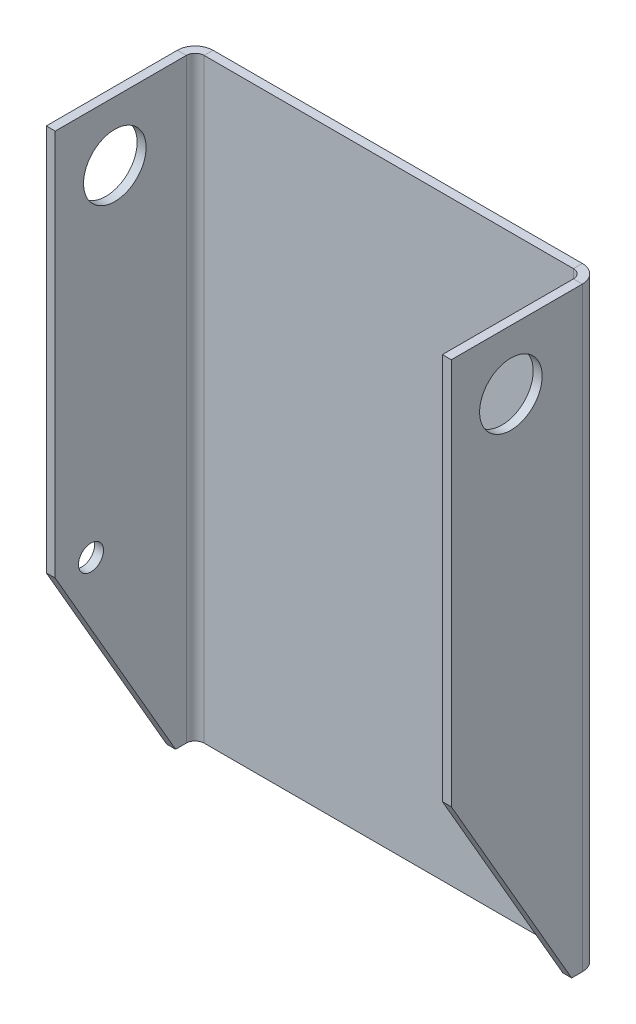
ISO-10303-21;
HEADER;
FILE_DESCRIPTION(('STEP AP214'),'2;1');
FILE_NAME('part.step','',(''),(''),'','','');
FILE_SCHEMA(('AUTOMOTIVE_DESIGN { 1 0 10303 214 1 1 1 1 }'));
ENDSEC;
DATA;
#1=APPLICATION_CONTEXT('core data for automotive mechanical design processes');
#2=APPLICATION_PROTOCOL_DEFINITION('international standard','automotive_design',2000,#1);
#3=PRODUCT_CONTEXT('',#1,'mechanical');
#4=PRODUCT('Part','Part','',(#3));
#5=PRODUCT_RELATED_PRODUCT_CATEGORY('part','',(#4));
#6=PRODUCT_DEFINITION_FORMATION('','',#4);
#7=PRODUCT_DEFINITION_CONTEXT('part definition',#1,'design');
#8=PRODUCT_DEFINITION('design','',#6,#7);
#9=PRODUCT_DEFINITION_SHAPE('','',#8);
#10=(LENGTH_UNIT() NAMED_UNIT(*) SI_UNIT(.MILLI.,.METRE.));
#11=(NAMED_UNIT(*) PLANE_ANGLE_UNIT() SI_UNIT($,.RADIAN.));
#12=(NAMED_UNIT(*) SI_UNIT($,.STERADIAN.) SOLID_ANGLE_UNIT());
#13=UNCERTAINTY_MEASURE_WITH_UNIT(LENGTH_MEASURE(1.E-05),#10,'distance_accuracy_value','');
#14=(GEOMETRIC_REPRESENTATION_CONTEXT(3) GLOBAL_UNCERTAINTY_ASSIGNED_CONTEXT((#13)) GLOBAL_UNIT_ASSIGNED_CONTEXT((#10,
#11,#12)) REPRESENTATION_CONTEXT('',''));
#15=CARTESIAN_POINT('',(0.,0.,0.));
#16=DIRECTION('',(0.,0.,1.));
#17=DIRECTION('',(1.,0.,0.));
#18=AXIS2_PLACEMENT_3D('',#15,#16,#17);
#19=CARTESIAN_POINT('',(-31.,100.,-4.71844785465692E-13));
#20=DIRECTION('',(0.,0.999999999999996,0.));
#21=DIRECTION('',(0.,0.,1.));
#22=AXIS2_PLACEMENT_3D('',#19,#20,#21);
#23=PLANE('',#22);
#24=DIRECTION('',(0.,0.,1.));
#25=VECTOR('',#24,1.);
#26=CARTESIAN_POINT('',(-31.,100.,-4.71844785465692E-13));
#27=LINE('',#26,#25);
#28=CARTESIAN_POINT('',(-31.,100.,-4.71844785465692E-13));
#29=VERTEX_POINT('',#28);
#30=CARTESIAN_POINT('',(-31.,100.,1.49999999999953));
#31=VERTEX_POINT('',#30);
#32=EDGE_CURVE('E311',#29,#31,#27,.T.);
#33=ORIENTED_EDGE('',*,*,#32,.F.);
#34=CARTESIAN_POINT('',(-30.9999999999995,100.,2.99999999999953));
#35=DIRECTION('',(0.,0.999999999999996,0.));
#36=DIRECTION('',(0.,0.,1.));
#37=AXIS2_PLACEMENT_3D('',#34,#35,#36);
#38=CIRCLE('',#37,3.);
#39=CARTESIAN_POINT('',(-33.9999999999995,100.,2.99999999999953));
#40=VERTEX_POINT('',#39);
#41=EDGE_CURVE('E227',#40,#29,#38,.F.);
#42=ORIENTED_EDGE('',*,*,#41,.F.);
#43=DIRECTION('',(-0.999999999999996,0.,0.));
#44=VECTOR('',#43,1.);
#45=CARTESIAN_POINT('',(-32.4999999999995,100.,2.9999999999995));
#46=LINE('',#45,#44);
#47=CARTESIAN_POINT('',(-32.4999999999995,100.,2.9999999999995));
#48=VERTEX_POINT('',#47);
#49=EDGE_CURVE('E308',#48,#40,#46,.T.);
#50=ORIENTED_EDGE('',*,*,#49,.F.);
#51=CARTESIAN_POINT('',(-30.9999999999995,100.,2.99999999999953));
#52=DIRECTION('',(0.,0.999999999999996,0.));
#53=DIRECTION('',(0.999999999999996,0.,0.));
#54=AXIS2_PLACEMENT_3D('',#51,#52,#53);
#55=CIRCLE('',#54,1.5);
#56=EDGE_CURVE('E243',#48,#31,#55,.F.);
#57=ORIENTED_EDGE('',*,*,#56,.T.);
#58=EDGE_LOOP('',(#33,#42,#50,#57));
#59=FACE_BOUND('',#58,.T.);
#60=ADVANCED_FACE('F42',(#59),#23,.T.);
#61=CARTESIAN_POINT('',(-32.4999999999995,100.,2.9999999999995));
#62=DIRECTION('',(0.,0.999999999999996,0.));
#63=DIRECTION('',(0.,0.,1.));
#64=AXIS2_PLACEMENT_3D('',#61,#62,#63);
#65=PLANE('',#64);
#66=DIRECTION('',(0.999999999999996,0.,0.));
#67=VECTOR('',#66,1.);
#68=CARTESIAN_POINT('',(-33.9999999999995,100.,-4.71844785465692E-13));
#69=LINE('',#68,#67);
#70=CARTESIAN_POINT('',(31.,100.,-4.71844785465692E-13));
#71=VERTEX_POINT('',#70);
#72=EDGE_CURVE('E223',#29,#71,#69,.T.);
#73=ORIENTED_EDGE('',*,*,#72,.F.);
#74=ORIENTED_EDGE('',*,*,#32,.T.);
#75=DIRECTION('',(0.999999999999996,0.,0.));
#76=VECTOR('',#75,1.);
#77=CARTESIAN_POINT('',(-34.,100.,1.49999999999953));
#78=LINE('',#77,#76);
#79=CARTESIAN_POINT('',(31.,100.,1.49999999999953));
#80=VERTEX_POINT('',#79);
#81=EDGE_CURVE('E247',#31,#80,#78,.T.);
#82=ORIENTED_EDGE('',*,*,#81,.T.);
#83=DIRECTION('',(0.,0.,-1.));
#84=VECTOR('',#83,1.);
#85=CARTESIAN_POINT('',(31.,100.,1.49999999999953));
#86=LINE('',#85,#84);
#87=EDGE_CURVE('E295',#80,#71,#86,.T.);
#88=ORIENTED_EDGE('',*,*,#87,.T.);
#89=EDGE_LOOP('',(#73,#74,#82,#88));
#90=FACE_BOUND('',#89,.T.);
#91=ADVANCED_FACE('F375',(#90),#65,.T.);
#92=CARTESIAN_POINT('',(-33.9999999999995,0.,2.99999999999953));
#93=DIRECTION('',(0.,-0.999999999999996,0.));
#94=DIRECTION('',(0.,0.,-1.));
#95=AXIS2_PLACEMENT_3D('',#92,#93,#94);
#96=PLANE('',#95);
#97=DIRECTION('',(0.999999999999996,0.,0.));
#98=VECTOR('',#97,1.);
#99=CARTESIAN_POINT('',(-33.9999999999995,0.,2.99999999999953));
#100=LINE('',#99,#98);
#101=CARTESIAN_POINT('',(-33.9999999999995,0.,2.99999999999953));
#102=VERTEX_POINT('',#101);
#103=CARTESIAN_POINT('',(-32.4999999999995,0.,2.99999999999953));
#104=VERTEX_POINT('',#103);
#105=EDGE_CURVE('E304',#102,#104,#100,.T.);
#106=ORIENTED_EDGE('',*,*,#105,.F.);
#107=CARTESIAN_POINT('',(-30.9999999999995,0.,2.99999999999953));
#108=DIRECTION('',(0.,0.999999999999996,0.));
#109=DIRECTION('',(0.,0.,1.));
#110=AXIS2_PLACEMENT_3D('',#107,#108,#109);
#111=CIRCLE('',#110,3.);
#112=CARTESIAN_POINT('',(-31.,0.,-4.71844785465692E-13));
#113=VERTEX_POINT('',#112);
#114=EDGE_CURVE('E188',#102,#113,#111,.F.);
#115=ORIENTED_EDGE('',*,*,#114,.T.);
#116=DIRECTION('',(0.,0.,-1.));
#117=VECTOR('',#116,1.);
#118=CARTESIAN_POINT('',(-31.,0.,1.49999999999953));
#119=LINE('',#118,#117);
#120=CARTESIAN_POINT('',(-31.,0.,1.49999999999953));
#121=VERTEX_POINT('',#120);
#122=EDGE_CURVE('E301',#121,#113,#119,.T.);
#123=ORIENTED_EDGE('',*,*,#122,.F.);
#124=CARTESIAN_POINT('',(-30.9999999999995,0.,2.99999999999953));
#125=DIRECTION('',(0.,0.999999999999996,0.));
#126=DIRECTION('',(0.999999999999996,0.,0.));
#127=AXIS2_PLACEMENT_3D('',#124,#125,#126);
#128=CIRCLE('',#127,1.5);
#129=EDGE_CURVE('E201',#104,#121,#128,.F.);
#130=ORIENTED_EDGE('',*,*,#129,.F.);
#131=EDGE_LOOP('',(#106,#115,#123,#130));
#132=FACE_BOUND('',#131,.T.);
#133=ADVANCED_FACE('F380',(#132),#96,.T.);
#134=CARTESIAN_POINT('',(-31.,0.,1.49999999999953));
#135=DIRECTION('',(0.,-0.999999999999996,0.));
#136=DIRECTION('',(0.,0.,-1.));
#137=AXIS2_PLACEMENT_3D('',#134,#135,#136);
#138=PLANE('',#137);
#139=DIRECTION('',(0.,0.,-1.));
#140=VECTOR('',#139,1.);
#141=CARTESIAN_POINT('',(-32.5,0.,24.9999999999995));
#142=LINE('',#141,#140);
#143=CARTESIAN_POINT('',(-32.4999999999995,0.,4.79274057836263));
#144=VERTEX_POINT('',#143);
#145=EDGE_CURVE('E198',#144,#104,#142,.T.);
#146=ORIENTED_EDGE('',*,*,#145,.F.);
#147=DIRECTION('',(-0.999999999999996,0.,0.));
#148=VECTOR('',#147,1.);
#149=CARTESIAN_POINT('',(-31.,0.,4.79274057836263));
#150=LINE('',#149,#148);
#151=CARTESIAN_POINT('',(-33.9999999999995,0.,4.7927405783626));
#152=VERTEX_POINT('',#151);
#153=EDGE_CURVE('E314',#144,#152,#150,.T.);
#154=ORIENTED_EDGE('',*,*,#153,.T.);
#155=DIRECTION('',(0.,0.,-1.));
#156=VECTOR('',#155,1.);
#157=CARTESIAN_POINT('',(-34.,0.,24.9999999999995));
#158=LINE('',#157,#156);
#159=EDGE_CURVE('E195',#152,#102,#158,.T.);
#160=ORIENTED_EDGE('',*,*,#159,.T.);
#161=ORIENTED_EDGE('',*,*,#105,.T.);
#162=EDGE_LOOP('',(#146,#154,#160,#161));
#163=FACE_BOUND('',#162,.T.);
#164=ADVANCED_FACE('F452',(#163),#138,.T.);
#165=CARTESIAN_POINT('',(33.9999999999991,100.,2.99999999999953));
#166=DIRECTION('',(0.,0.999999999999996,0.));
#167=DIRECTION('',(0.,0.,1.));
#168=AXIS2_PLACEMENT_3D('',#165,#166,#167);
#169=PLANE('',#168);
#170=DIRECTION('',(-0.999999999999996,0.,0.));
#171=VECTOR('',#170,1.);
#172=CARTESIAN_POINT('',(33.9999999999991,100.,2.99999999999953));
#173=LINE('',#172,#171);
#174=CARTESIAN_POINT('',(33.9999999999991,100.,2.99999999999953));
#175=VERTEX_POINT('',#174);
#176=CARTESIAN_POINT('',(32.4999999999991,100.,2.99999999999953));
#177=VERTEX_POINT('',#176);
#178=EDGE_CURVE('E298',#175,#177,#173,.T.);
#179=ORIENTED_EDGE('',*,*,#178,.F.);
#180=CARTESIAN_POINT('',(30.9999999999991,100.,2.99999999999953));
#181=DIRECTION('',(0.,0.999999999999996,0.));
#182=DIRECTION('',(0.,0.,1.));
#183=AXIS2_PLACEMENT_3D('',#180,#181,#182);
#184=CIRCLE('',#183,3.);
#185=EDGE_CURVE('E168',#71,#175,#184,.F.);
#186=ORIENTED_EDGE('',*,*,#185,.F.);
#187=ORIENTED_EDGE('',*,*,#87,.F.);
#188=CARTESIAN_POINT('',(30.9999999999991,100.,2.99999999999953));
#189=DIRECTION('',(0.,0.999999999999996,0.));
#190=DIRECTION('',(0.999999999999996,0.,0.));
#191=AXIS2_PLACEMENT_3D('',#188,#189,#190);
#192=CIRCLE('',#191,1.5);
#193=EDGE_CURVE('E251',#80,#177,#192,.F.);
#194=ORIENTED_EDGE('',*,*,#193,.T.);
#195=EDGE_LOOP('',(#179,#186,#187,#194));
#196=FACE_BOUND('',#195,.T.);
#197=ADVANCED_FACE('F424',(#196),#169,.T.);
#198=CARTESIAN_POINT('',(31.,100.,1.49999999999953));
#199=DIRECTION('',(0.,0.999999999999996,0.));
#200=DIRECTION('',(0.,0.,1.));
#201=AXIS2_PLACEMENT_3D('',#198,#199,#200);
#202=PLANE('',#201);
#203=DIRECTION('',(0.,0.,1.));
#204=VECTOR('',#203,1.);
#205=CARTESIAN_POINT('',(34.,100.,-4.71844785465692E-13));
#206=LINE('',#205,#204);
#207=CARTESIAN_POINT('',(34.,100.,24.9999999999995));
#208=VERTEX_POINT('',#207);
#209=EDGE_CURVE('E218',#175,#208,#206,.T.);
#210=ORIENTED_EDGE('',*,*,#209,.F.);
#211=ORIENTED_EDGE('',*,*,#178,.T.);
#212=DIRECTION('',(0.,0.,-1.));
#213=VECTOR('',#212,1.);
#214=CARTESIAN_POINT('',(32.5,100.,-4.71844785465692E-13));
#215=LINE('',#214,#213);
#216=CARTESIAN_POINT('',(32.5,100.,24.9999999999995));
#217=VERTEX_POINT('',#216);
#218=EDGE_CURVE('E212',#177,#217,#215,.F.);
#219=ORIENTED_EDGE('',*,*,#218,.T.);
#220=DIRECTION('',(-0.999999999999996,0.,0.));
#221=VECTOR('',#220,1.);
#222=CARTESIAN_POINT('',(34.,100.,24.9999999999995));
#223=LINE('',#222,#221);
#224=EDGE_CURVE('E215',#208,#217,#223,.T.);
#225=ORIENTED_EDGE('',*,*,#224,.F.);
#226=EDGE_LOOP('',(#210,#211,#219,#225));
#227=FACE_BOUND('',#226,.T.);
#228=ADVANCED_FACE('F426',(#227),#202,.T.);
#229=CARTESIAN_POINT('',(31.,0.,0.));
#230=DIRECTION('',(0.,-0.999999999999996,0.));
#231=DIRECTION('',(0.,0.,-1.));
#232=AXIS2_PLACEMENT_3D('',#229,#230,#231);
#233=PLANE('',#232);
#234=DIRECTION('',(0.,0.,1.));
#235=VECTOR('',#234,1.);
#236=CARTESIAN_POINT('',(31.,0.,0.));
#237=LINE('',#236,#235);
#238=CARTESIAN_POINT('',(31.,0.,0.));
#239=VERTEX_POINT('',#238);
#240=CARTESIAN_POINT('',(31.,0.,1.5));
#241=VERTEX_POINT('',#240);
#242=EDGE_CURVE('E155',#239,#241,#237,.T.);
#243=ORIENTED_EDGE('',*,*,#242,.F.);
#244=CARTESIAN_POINT('',(31.,0.,3.));
#245=DIRECTION('',(0.,0.999999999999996,0.));
#246=DIRECTION('',(0.,0.,1.));
#247=AXIS2_PLACEMENT_3D('',#244,#245,#246);
#248=CIRCLE('',#247,3.);
#249=CARTESIAN_POINT('',(34.,0.,2.99999999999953));
#250=VERTEX_POINT('',#249);
#251=EDGE_CURVE('E165',#239,#250,#248,.F.);
#252=ORIENTED_EDGE('',*,*,#251,.T.);
#253=DIRECTION('',(0.999999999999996,0.,0.));
#254=VECTOR('',#253,1.);
#255=CARTESIAN_POINT('',(32.5,0.,2.99999999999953));
#256=LINE('',#255,#254);
#257=CARTESIAN_POINT('',(32.5,0.,2.99999999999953));
#258=VERTEX_POINT('',#257);
#259=EDGE_CURVE('E142',#258,#250,#256,.T.);
#260=ORIENTED_EDGE('',*,*,#259,.F.);
#261=CARTESIAN_POINT('',(31.,0.,3.));
#262=DIRECTION('',(0.,0.999999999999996,0.));
#263=DIRECTION('',(0.999999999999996,0.,0.));
#264=AXIS2_PLACEMENT_3D('',#261,#262,#263);
#265=CIRCLE('',#264,1.5);
#266=EDGE_CURVE('E209',#241,#258,#265,.F.);
#267=ORIENTED_EDGE('',*,*,#266,.F.);
#268=EDGE_LOOP('',(#243,#252,#260,#267));
#269=FACE_BOUND('',#268,.T.);
#270=ADVANCED_FACE('F180',(#269),#233,.T.);
#271=CARTESIAN_POINT('',(32.5,0.,2.99999999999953));
#272=DIRECTION('',(0.,-0.999999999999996,0.));
#273=DIRECTION('',(0.,0.,-1.));
#274=AXIS2_PLACEMENT_3D('',#271,#272,#273);
#275=PLANE('',#274);
#276=DIRECTION('',(0.999999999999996,0.,0.));
#277=VECTOR('',#276,1.);
#278=CARTESIAN_POINT('',(-34.,0.,-4.71844785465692E-13));
#279=LINE('',#278,#277);
#280=EDGE_CURVE('E183',#113,#239,#279,.T.);
#281=ORIENTED_EDGE('',*,*,#280,.T.);
#282=ORIENTED_EDGE('',*,*,#242,.T.);
#283=DIRECTION('',(0.999999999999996,0.,0.));
#284=VECTOR('',#283,1.);
#285=CARTESIAN_POINT('',(-34.,0.,1.49999999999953));
#286=LINE('',#285,#284);
#287=EDGE_CURVE('E205',#121,#241,#286,.T.);
#288=ORIENTED_EDGE('',*,*,#287,.F.);
#289=ORIENTED_EDGE('',*,*,#122,.T.);
#290=EDGE_LOOP('',(#281,#282,#288,#289));
#291=FACE_BOUND('',#290,.T.);
#292=ADVANCED_FACE('F439',(#291),#275,.T.);
#293=CARTESIAN_POINT('',(32.5,100.,-4.71844785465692E-13));
#294=DIRECTION('',(0.999999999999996,0.,0.));
#295=DIRECTION('',(0.,0.,-1.));
#296=AXIS2_PLACEMENT_3D('',#293,#294,#295);
#297=PLANE('',#296);
#298=CARTESIAN_POINT('',(32.5,90.0000000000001,15.));
#299=DIRECTION('',(0.999999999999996,0.,0.));
#300=DIRECTION('',(0.,0.,-1.));
#301=AXIS2_PLACEMENT_3D('',#298,#299,#300);
#302=CIRCLE('',#301,5.25);
#303=CARTESIAN_POINT('',(32.5,90.,9.74999999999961));
#304=VERTEX_POINT('',#303);
#305=EDGE_CURVE('E319',#304,#304,#302,.T.);
#306=ORIENTED_EDGE('',*,*,#305,.T.);
#307=EDGE_LOOP('',(#306));
#308=FACE_BOUND('',#307,.T.);
#309=DIRECTION('',(0.,0.,-1.));
#310=VECTOR('',#309,1.);
#311=CARTESIAN_POINT('',(32.5,0.,-4.71844785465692E-13));
#312=LINE('',#311,#310);
#313=CARTESIAN_POINT('',(32.5,0.,4.7927405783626));
#314=VERTEX_POINT('',#313);
#315=EDGE_CURVE('E149',#258,#314,#312,.F.);
#316=ORIENTED_EDGE('',*,*,#315,.T.);
#317=DIRECTION('',(0.,0.866025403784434,0.499999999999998));
#318=VECTOR('',#317,1.);
#319=CARTESIAN_POINT('',(32.5,0.,4.7927405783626));
#320=LINE('',#319,#318);
#321=CARTESIAN_POINT('',(32.5,35.0000000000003,24.9999999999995));
#322=VERTEX_POINT('',#321);
#323=EDGE_CURVE('E64',#314,#322,#320,.T.);
#324=ORIENTED_EDGE('',*,*,#323,.T.);
#325=DIRECTION('',(0.,-0.999999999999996,0.));
#326=VECTOR('',#325,1.);
#327=CARTESIAN_POINT('',(32.5,100.,24.9999999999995));
#328=LINE('',#327,#326);
#329=EDGE_CURVE('E156',#217,#322,#328,.T.);
#330=ORIENTED_EDGE('',*,*,#329,.F.);
#331=ORIENTED_EDGE('',*,*,#218,.F.);
#332=DIRECTION('',(0.,-0.999999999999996,0.));
#333=VECTOR('',#332,1.);
#334=CARTESIAN_POINT('',(32.4999999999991,100.,2.99999999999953));
#335=LINE('',#334,#333);
#336=EDGE_CURVE('E255',#177,#258,#335,.T.);
#337=ORIENTED_EDGE('',*,*,#336,.T.);
#338=EDGE_LOOP('',(#316,#324,#330,#331,#337));
#339=FACE_BOUND('',#338,.T.);
#340=ADVANCED_FACE('F358',(#308,#339),#297,.F.);
#341=CARTESIAN_POINT('',(34.,100.,24.9999999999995));
#342=DIRECTION('',(0.,0.,1.));
#343=DIRECTION('',(0.999999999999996,0.,0.));
#344=AXIS2_PLACEMENT_3D('',#341,#342,#343);
#345=PLANE('',#344);
#346=ORIENTED_EDGE('',*,*,#329,.T.);
#347=DIRECTION('',(0.999999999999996,0.,0.));
#348=VECTOR('',#347,1.);
#349=CARTESIAN_POINT('',(34.,35.0000000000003,24.9999999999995));
#350=LINE('',#349,#348);
#351=CARTESIAN_POINT('',(34.,35.0000000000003,24.9999999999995));
#352=VERTEX_POINT('',#351);
#353=EDGE_CURVE('E50',#322,#352,#350,.T.);
#354=ORIENTED_EDGE('',*,*,#353,.T.);
#355=DIRECTION('',(0.,-0.999999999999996,0.));
#356=VECTOR('',#355,1.);
#357=CARTESIAN_POINT('',(34.,100.,24.9999999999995));
#358=LINE('',#357,#356);
#359=EDGE_CURVE('E173',#208,#352,#358,.T.);
#360=ORIENTED_EDGE('',*,*,#359,.F.);
#361=ORIENTED_EDGE('',*,*,#224,.T.);
#362=EDGE_LOOP('',(#346,#354,#360,#361));
#363=FACE_BOUND('',#362,.T.);
#364=ADVANCED_FACE('F430',(#363),#345,.T.);
#365=CARTESIAN_POINT('',(34.,100.,-4.71844785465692E-13));
#366=DIRECTION('',(0.999999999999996,0.,0.));
#367=DIRECTION('',(0.,0.,-1.));
#368=AXIS2_PLACEMENT_3D('',#365,#366,#367);
#369=PLANE('',#368);
#370=CARTESIAN_POINT('',(34.,90.0000000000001,14.9999999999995));
#371=DIRECTION('',(0.999999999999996,0.,0.));
#372=DIRECTION('',(0.,0.,-1.));
#373=AXIS2_PLACEMENT_3D('',#370,#371,#372);
#374=CIRCLE('',#373,5.25);
#375=CARTESIAN_POINT('',(34.,90.,9.74999999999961));
#376=VERTEX_POINT('',#375);
#377=EDGE_CURVE('E325',#376,#376,#374,.T.);
#378=ORIENTED_EDGE('',*,*,#377,.F.);
#379=EDGE_LOOP('',(#378));
#380=FACE_BOUND('',#379,.T.);
#381=ORIENTED_EDGE('',*,*,#359,.T.);
#382=DIRECTION('',(0.,-0.866025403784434,-0.499999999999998));
#383=VECTOR('',#382,1.);
#384=CARTESIAN_POINT('',(33.9999999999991,72.9246824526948,46.8958256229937));
#385=LINE('',#384,#383);
#386=CARTESIAN_POINT('',(34.,0.,4.7927405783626));
#387=VERTEX_POINT('',#386);
#388=EDGE_CURVE('E11',#352,#387,#385,.T.);
#389=ORIENTED_EDGE('',*,*,#388,.T.);
#390=DIRECTION('',(0.,0.,1.));
#391=VECTOR('',#390,1.);
#392=CARTESIAN_POINT('',(34.,0.,-4.71844785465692E-13));
#393=LINE('',#392,#391);
#394=EDGE_CURVE('E147',#250,#387,#393,.T.);
#395=ORIENTED_EDGE('',*,*,#394,.F.);
#396=DIRECTION('',(0.,-0.999999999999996,0.));
#397=VECTOR('',#396,1.);
#398=CARTESIAN_POINT('',(33.9999999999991,100.,2.99999999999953));
#399=LINE('',#398,#397);
#400=EDGE_CURVE('E162',#175,#250,#399,.T.);
#401=ORIENTED_EDGE('',*,*,#400,.F.);
#402=ORIENTED_EDGE('',*,*,#209,.T.);
#403=EDGE_LOOP('',(#381,#389,#395,#401,#402));
#404=FACE_BOUND('',#403,.T.);
#405=ADVANCED_FACE('F176',(#380,#404),#369,.T.);
#406=CARTESIAN_POINT('',(30.9999999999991,100.,2.99999999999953));
#407=DIRECTION('',(0.,-0.999999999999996,0.));
#408=DIRECTION('',(0.,0.,-1.));
#409=AXIS2_PLACEMENT_3D('',#406,#407,#408);
#410=CYLINDRICAL_SURFACE('',#409,3.);
#411=ORIENTED_EDGE('',*,*,#251,.F.);
#412=DIRECTION('',(0.,-0.999999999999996,0.));
#413=VECTOR('',#412,1.);
#414=CARTESIAN_POINT('',(31.,100.,-4.71844785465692E-13));
#415=LINE('',#414,#413);
#416=EDGE_CURVE('E174',#71,#239,#415,.T.);
#417=ORIENTED_EDGE('',*,*,#416,.F.);
#418=ORIENTED_EDGE('',*,*,#185,.T.);
#419=ORIENTED_EDGE('',*,*,#400,.T.);
#420=EDGE_LOOP('',(#411,#417,#418,#419));
#421=FACE_BOUND('',#420,.T.);
#422=ADVANCED_FACE('F163',(#421),#410,.T.);
#423=CARTESIAN_POINT('',(-33.9999999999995,100.,-4.71844785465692E-13));
#424=DIRECTION('',(0.,0.,-1.));
#425=DIRECTION('',(-0.999999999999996,0.,0.));
#426=AXIS2_PLACEMENT_3D('',#423,#424,#425);
#427=PLANE('',#426);
#428=ORIENTED_EDGE('',*,*,#280,.F.);
#429=DIRECTION('',(0.,-0.999999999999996,0.));
#430=VECTOR('',#429,1.);
#431=CARTESIAN_POINT('',(-31.,100.,-4.71844785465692E-13));
#432=LINE('',#431,#430);
#433=EDGE_CURVE('E283',#29,#113,#432,.T.);
#434=ORIENTED_EDGE('',*,*,#433,.F.);
#435=ORIENTED_EDGE('',*,*,#72,.T.);
#436=ORIENTED_EDGE('',*,*,#416,.T.);
#437=EDGE_LOOP('',(#428,#434,#435,#436));
#438=FACE_BOUND('',#437,.T.);
#439=ADVANCED_FACE('F389',(#438),#427,.T.);
#440=CARTESIAN_POINT('',(-30.9999999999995,100.,2.99999999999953));
#441=DIRECTION('',(0.,-0.999999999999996,0.));
#442=DIRECTION('',(0.,0.,-1.));
#443=AXIS2_PLACEMENT_3D('',#440,#441,#442);
#444=CYLINDRICAL_SURFACE('',#443,3.);
#445=ORIENTED_EDGE('',*,*,#114,.F.);
#446=DIRECTION('',(0.,-0.999999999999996,0.));
#447=VECTOR('',#446,1.);
#448=CARTESIAN_POINT('',(-33.9999999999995,100.,2.99999999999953));
#449=LINE('',#448,#447);
#450=EDGE_CURVE('E279',#40,#102,#449,.T.);
#451=ORIENTED_EDGE('',*,*,#450,.F.);
#452=ORIENTED_EDGE('',*,*,#41,.T.);
#453=ORIENTED_EDGE('',*,*,#433,.T.);
#454=EDGE_LOOP('',(#445,#451,#452,#453));
#455=FACE_BOUND('',#454,.T.);
#456=ADVANCED_FACE('F393',(#455),#444,.T.);
#457=CARTESIAN_POINT('',(-33.9999999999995,100.,24.9999999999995));
#458=DIRECTION('',(-0.999999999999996,0.,0.));
#459=DIRECTION('',(0.,0.,1.));
#460=AXIS2_PLACEMENT_3D('',#457,#458,#459);
#461=PLANE('',#460);
#462=CARTESIAN_POINT('',(-34.,34.9999999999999,18.9999999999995));
#463=DIRECTION('',(-0.999999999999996,0.,0.));
#464=DIRECTION('',(0.,0.,1.));
#465=AXIS2_PLACEMENT_3D('',#462,#463,#464);
#466=CIRCLE('',#465,2.09999999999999);
#467=CARTESIAN_POINT('',(-34.,34.9999999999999,21.0999999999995));
#468=VERTEX_POINT('',#467);
#469=EDGE_CURVE('E326',#468,#468,#466,.T.);
#470=ORIENTED_EDGE('',*,*,#469,.F.);
#471=EDGE_LOOP('',(#470));
#472=FACE_BOUND('',#471,.T.);
#473=CARTESIAN_POINT('',(-34.,90.,14.9999999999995));
#474=DIRECTION('',(0.999999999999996,0.,0.));
#475=DIRECTION('',(0.,0.,-1.));
#476=AXIS2_PLACEMENT_3D('',#473,#474,#475);
#477=CIRCLE('',#476,5.25);
#478=CARTESIAN_POINT('',(-34.,90.,9.74999999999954));
#479=VERTEX_POINT('',#478);
#480=EDGE_CURVE('E320',#479,#479,#477,.T.);
#481=ORIENTED_EDGE('',*,*,#480,.T.);
#482=EDGE_LOOP('',(#481));
#483=FACE_BOUND('',#482,.T.);
#484=ORIENTED_EDGE('',*,*,#159,.F.);
#485=DIRECTION('',(0.,-0.866025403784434,-0.499999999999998));
#486=VECTOR('',#485,1.);
#487=CARTESIAN_POINT('',(-33.9999999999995,83.7500000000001,53.1458256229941));
#488=LINE('',#487,#486);
#489=CARTESIAN_POINT('',(-34.,35.0000000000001,24.9999999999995));
#490=VERTEX_POINT('',#489);
#491=EDGE_CURVE('E330',#152,#490,#488,.F.);
#492=ORIENTED_EDGE('',*,*,#491,.T.);
#493=DIRECTION('',(0.,-0.999999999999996,0.));
#494=VECTOR('',#493,1.);
#495=CARTESIAN_POINT('',(-33.9999999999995,100.,24.9999999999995));
#496=LINE('',#495,#494);
#497=CARTESIAN_POINT('',(-33.9999999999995,100.,24.9999999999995));
#498=VERTEX_POINT('',#497);
#499=EDGE_CURVE('E275',#498,#490,#496,.T.);
#500=ORIENTED_EDGE('',*,*,#499,.F.);
#501=DIRECTION('',(0.,0.,-1.));
#502=VECTOR('',#501,1.);
#503=CARTESIAN_POINT('',(-33.9999999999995,100.,24.9999999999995));
#504=LINE('',#503,#502);
#505=EDGE_CURVE('E231',#498,#40,#504,.T.);
#506=ORIENTED_EDGE('',*,*,#505,.T.);
#507=ORIENTED_EDGE('',*,*,#450,.T.);
#508=EDGE_LOOP('',(#484,#492,#500,#506,#507));
#509=FACE_BOUND('',#508,.T.);
#510=ADVANCED_FACE('F396',(#472,#483,#509),#461,.T.);
#511=CARTESIAN_POINT('',(-32.4999999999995,100.,24.9999999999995));
#512=DIRECTION('',(0.,0.,1.));
#513=DIRECTION('',(0.999999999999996,0.,0.));
#514=AXIS2_PLACEMENT_3D('',#511,#512,#513);
#515=PLANE('',#514);
#516=ORIENTED_EDGE('',*,*,#499,.T.);
#517=DIRECTION('',(0.999999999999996,0.,0.));
#518=VECTOR('',#517,1.);
#519=CARTESIAN_POINT('',(-32.5,35.0000000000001,24.9999999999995));
#520=LINE('',#519,#518);
#521=CARTESIAN_POINT('',(-32.5,35.0000000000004,24.9999999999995));
#522=VERTEX_POINT('',#521);
#523=EDGE_CURVE('E333',#490,#522,#520,.T.);
#524=ORIENTED_EDGE('',*,*,#523,.T.);
#525=DIRECTION('',(0.,-0.999999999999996,0.));
#526=VECTOR('',#525,1.);
#527=CARTESIAN_POINT('',(-32.4999999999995,100.,24.9999999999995));
#528=LINE('',#527,#526);
#529=CARTESIAN_POINT('',(-32.4999999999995,100.,24.9999999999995));
#530=VERTEX_POINT('',#529);
#531=EDGE_CURVE('E271',#530,#522,#528,.T.);
#532=ORIENTED_EDGE('',*,*,#531,.F.);
#533=DIRECTION('',(-0.999999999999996,0.,0.));
#534=VECTOR('',#533,1.);
#535=CARTESIAN_POINT('',(-32.4999999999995,100.,24.9999999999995));
#536=LINE('',#535,#534);
#537=EDGE_CURVE('E235',#530,#498,#536,.T.);
#538=ORIENTED_EDGE('',*,*,#537,.T.);
#539=EDGE_LOOP('',(#516,#524,#532,#538));
#540=FACE_BOUND('',#539,.T.);
#541=ADVANCED_FACE('F402',(#540),#515,.T.);
#542=CARTESIAN_POINT('',(-32.4999999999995,100.,24.9999999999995));
#543=DIRECTION('',(-0.999999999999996,0.,0.));
#544=DIRECTION('',(0.,0.,1.));
#545=AXIS2_PLACEMENT_3D('',#542,#543,#544);
#546=PLANE('',#545);
#547=CARTESIAN_POINT('',(-32.5,34.9999999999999,18.9999999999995));
#548=DIRECTION('',(-0.999999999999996,0.,0.));
#549=DIRECTION('',(0.,0.,1.));
#550=AXIS2_PLACEMENT_3D('',#547,#548,#549);
#551=CIRCLE('',#550,2.09999999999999);
#552=CARTESIAN_POINT('',(-32.5,34.9999999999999,21.0999999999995));
#553=VERTEX_POINT('',#552);
#554=EDGE_CURVE('E321',#553,#553,#551,.T.);
#555=ORIENTED_EDGE('',*,*,#554,.T.);
#556=EDGE_LOOP('',(#555));
#557=FACE_BOUND('',#556,.T.);
#558=CARTESIAN_POINT('',(-32.5,90.,14.9999999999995));
#559=DIRECTION('',(-0.999999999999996,0.,0.));
#560=DIRECTION('',(0.,0.,1.));
#561=AXIS2_PLACEMENT_3D('',#558,#559,#560);
#562=CIRCLE('',#561,5.25);
#563=CARTESIAN_POINT('',(-32.5,90.,9.74999999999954));
#564=VERTEX_POINT('',#563);
#565=EDGE_CURVE('E315',#564,#564,#562,.T.);
#566=ORIENTED_EDGE('',*,*,#565,.T.);
#567=EDGE_LOOP('',(#566));
#568=FACE_BOUND('',#567,.T.);
#569=ORIENTED_EDGE('',*,*,#531,.T.);
#570=DIRECTION('',(0.,0.866025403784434,0.499999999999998));
#571=VECTOR('',#570,1.);
#572=CARTESIAN_POINT('',(-32.4999999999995,0.,4.79274057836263));
#573=LINE('',#572,#571);
#574=EDGE_CURVE('E336',#522,#144,#573,.F.);
#575=ORIENTED_EDGE('',*,*,#574,.T.);
#576=ORIENTED_EDGE('',*,*,#145,.T.);
#577=DIRECTION('',(0.,-0.999999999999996,0.));
#578=VECTOR('',#577,1.);
#579=CARTESIAN_POINT('',(-32.4999999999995,100.,2.9999999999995));
#580=LINE('',#579,#578);
#581=EDGE_CURVE('E267',#48,#104,#580,.T.);
#582=ORIENTED_EDGE('',*,*,#581,.F.);
#583=DIRECTION('',(0.,0.,-1.));
#584=VECTOR('',#583,1.);
#585=CARTESIAN_POINT('',(-32.4999999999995,100.,24.9999999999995));
#586=LINE('',#585,#584);
#587=EDGE_CURVE('E239',#530,#48,#586,.T.);
#588=ORIENTED_EDGE('',*,*,#587,.F.);
#589=EDGE_LOOP('',(#569,#575,#576,#582,#588));
#590=FACE_BOUND('',#589,.T.);
#591=ADVANCED_FACE('F408',(#557,#568,#590),#546,.F.);
#592=CARTESIAN_POINT('',(-30.9999999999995,100.,2.99999999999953));
#593=DIRECTION('',(0.,-0.999999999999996,0.));
#594=DIRECTION('',(0.,0.,-1.));
#595=AXIS2_PLACEMENT_3D('',#592,#593,#594);
#596=CYLINDRICAL_SURFACE('',#595,1.5);
#597=ORIENTED_EDGE('',*,*,#129,.T.);
#598=DIRECTION('',(0.,-0.999999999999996,0.));
#599=VECTOR('',#598,1.);
#600=CARTESIAN_POINT('',(-31.,100.,1.49999999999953));
#601=LINE('',#600,#599);
#602=EDGE_CURVE('E263',#31,#121,#601,.T.);
#603=ORIENTED_EDGE('',*,*,#602,.F.);
#604=ORIENTED_EDGE('',*,*,#56,.F.);
#605=ORIENTED_EDGE('',*,*,#581,.T.);
#606=EDGE_LOOP('',(#597,#603,#604,#605));
#607=FACE_BOUND('',#606,.T.);
#608=ADVANCED_FACE('F412',(#607),#596,.F.);
#609=CARTESIAN_POINT('',(-34.,100.,1.49999999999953));
#610=DIRECTION('',(0.,0.,-1.));
#611=DIRECTION('',(-0.999999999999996,0.,0.));
#612=AXIS2_PLACEMENT_3D('',#609,#610,#611);
#613=PLANE('',#612);
#614=ORIENTED_EDGE('',*,*,#287,.T.);
#615=DIRECTION('',(0.,-0.999999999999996,0.));
#616=VECTOR('',#615,1.);
#617=CARTESIAN_POINT('',(31.,100.,1.49999999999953));
#618=LINE('',#617,#616);
#619=EDGE_CURVE('E259',#80,#241,#618,.T.);
#620=ORIENTED_EDGE('',*,*,#619,.F.);
#621=ORIENTED_EDGE('',*,*,#81,.F.);
#622=ORIENTED_EDGE('',*,*,#602,.T.);
#623=EDGE_LOOP('',(#614,#620,#621,#622));
#624=FACE_BOUND('',#623,.T.);
#625=ADVANCED_FACE('F417',(#624),#613,.F.);
#626=CARTESIAN_POINT('',(30.9999999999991,100.,2.99999999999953));
#627=DIRECTION('',(0.,-0.999999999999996,0.));
#628=DIRECTION('',(0.,0.,-1.));
#629=AXIS2_PLACEMENT_3D('',#626,#627,#628);
#630=CYLINDRICAL_SURFACE('',#629,1.5);
#631=ORIENTED_EDGE('',*,*,#266,.T.);
#632=ORIENTED_EDGE('',*,*,#336,.F.);
#633=ORIENTED_EDGE('',*,*,#193,.F.);
#634=ORIENTED_EDGE('',*,*,#619,.T.);
#635=EDGE_LOOP('',(#631,#632,#633,#634));
#636=FACE_BOUND('',#635,.T.);
#637=ADVANCED_FACE('F421',(#636),#630,.F.);
#638=CARTESIAN_POINT('',(30.9999999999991,100.,2.99999999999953));
#639=DIRECTION('',(0.,0.999999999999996,0.));
#640=DIRECTION('',(0.,0.,1.));
#641=AXIS2_PLACEMENT_3D('',#638,#639,#640);
#642=PLANE('',#641);
#643=ORIENTED_EDGE('',*,*,#587,.T.);
#644=ORIENTED_EDGE('',*,*,#49,.T.);
#645=ORIENTED_EDGE('',*,*,#505,.F.);
#646=ORIENTED_EDGE('',*,*,#537,.F.);
#647=EDGE_LOOP('',(#643,#644,#645,#646));
#648=FACE_BOUND('',#647,.T.);
#649=ADVANCED_FACE('F400',(#648),#642,.T.);
#650=CARTESIAN_POINT('',(31.,0.,3.));
#651=DIRECTION('',(0.,0.999999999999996,0.));
#652=DIRECTION('',(0.,0.,1.));
#653=AXIS2_PLACEMENT_3D('',#650,#651,#652);
#654=PLANE('',#653);
#655=ORIENTED_EDGE('',*,*,#394,.T.);
#656=DIRECTION('',(-0.999999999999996,0.,0.));
#657=VECTOR('',#656,1.);
#658=CARTESIAN_POINT('',(32.5,0.,4.7927405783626));
#659=LINE('',#658,#657);
#660=EDGE_CURVE('E339',#387,#314,#659,.T.);
#661=ORIENTED_EDGE('',*,*,#660,.T.);
#662=ORIENTED_EDGE('',*,*,#315,.F.);
#663=ORIENTED_EDGE('',*,*,#259,.T.);
#664=EDGE_LOOP('',(#655,#661,#662,#663));
#665=FACE_BOUND('',#664,.T.);
#666=ADVANCED_FACE('F144',(#665),#654,.F.);
#667=CARTESIAN_POINT('',(-34.,90.,14.9999999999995));
#668=DIRECTION('',(0.999999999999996,0.,0.));
#669=DIRECTION('',(0.,0.,-1.));
#670=AXIS2_PLACEMENT_3D('',#667,#668,#669);
#671=CYLINDRICAL_SURFACE('',#670,5.25);
#672=CARTESIAN_POINT('',(-34.,90.,9.74999999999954));
#673=CARTESIAN_POINT('',(-33.984375,90.,9.74999999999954));
#674=CARTESIAN_POINT('',(-33.96875,90.,9.74999999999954));
#675=CARTESIAN_POINT('',(-33.9375,90.,9.74999999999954));
#676=CARTESIAN_POINT('',(-33.921875,90.,9.74999999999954));
#677=CARTESIAN_POINT('',(-33.890625,90.,9.74999999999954));
#678=CARTESIAN_POINT('',(-33.875,90.,9.74999999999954));
#679=CARTESIAN_POINT('',(-33.84375,90.,9.74999999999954));
#680=CARTESIAN_POINT('',(-33.828125,90.,9.74999999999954));
#681=CARTESIAN_POINT('',(-33.796875,90.,9.74999999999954));
#682=CARTESIAN_POINT('',(-33.78125,90.,9.74999999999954));
#683=CARTESIAN_POINT('',(-33.75,90.,9.74999999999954));
#684=CARTESIAN_POINT('',(-33.734375,90.,9.74999999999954));
#685=CARTESIAN_POINT('',(-33.703125,90.,9.74999999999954));
#686=CARTESIAN_POINT('',(-33.6875,90.,9.74999999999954));
#687=CARTESIAN_POINT('',(-33.65625,90.,9.74999999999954));
#688=CARTESIAN_POINT('',(-33.640625,90.,9.74999999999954));
#689=CARTESIAN_POINT('',(-33.609375,90.,9.74999999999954));
#690=CARTESIAN_POINT('',(-33.59375,90.,9.74999999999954));
#691=CARTESIAN_POINT('',(-33.5625,90.,9.74999999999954));
#692=CARTESIAN_POINT('',(-33.546875,90.,9.74999999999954));
#693=CARTESIAN_POINT('',(-33.515625,90.,9.74999999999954));
#694=CARTESIAN_POINT('',(-33.5,90.,9.74999999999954));
#695=CARTESIAN_POINT('',(-33.46875,90.,9.74999999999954));
#696=CARTESIAN_POINT('',(-33.453125,90.,9.74999999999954));
#697=CARTESIAN_POINT('',(-33.421875,90.,9.74999999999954));
#698=CARTESIAN_POINT('',(-33.40625,90.,9.74999999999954));
#699=CARTESIAN_POINT('',(-33.375,90.,9.74999999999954));
#700=CARTESIAN_POINT('',(-33.359375,90.,9.74999999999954));
#701=CARTESIAN_POINT('',(-33.328125,90.,9.74999999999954));
#702=CARTESIAN_POINT('',(-33.3125,90.,9.74999999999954));
#703=CARTESIAN_POINT('',(-33.28125,90.,9.74999999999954));
#704=CARTESIAN_POINT('',(-33.265625,90.,9.74999999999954));
#705=CARTESIAN_POINT('',(-33.234375,90.,9.74999999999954));
#706=CARTESIAN_POINT('',(-33.21875,90.,9.74999999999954));
#707=CARTESIAN_POINT('',(-33.1875,90.,9.74999999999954));
#708=CARTESIAN_POINT('',(-33.171875,90.,9.74999999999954));
#709=CARTESIAN_POINT('',(-33.140625,90.,9.74999999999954));
#710=CARTESIAN_POINT('',(-33.125,90.,9.74999999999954));
#711=CARTESIAN_POINT('',(-33.09375,90.,9.74999999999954));
#712=CARTESIAN_POINT('',(-33.078125,90.,9.74999999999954));
#713=CARTESIAN_POINT('',(-33.046875,90.,9.74999999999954));
#714=CARTESIAN_POINT('',(-33.03125,90.,9.74999999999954));
#715=CARTESIAN_POINT('',(-33.,90.,9.74999999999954));
#716=CARTESIAN_POINT('',(-32.984375,90.,9.74999999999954));
#717=CARTESIAN_POINT('',(-32.953125,90.,9.74999999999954));
#718=CARTESIAN_POINT('',(-32.9375,90.,9.74999999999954));
#719=CARTESIAN_POINT('',(-32.90625,90.,9.74999999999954));
#720=CARTESIAN_POINT('',(-32.890625,90.,9.74999999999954));
#721=CARTESIAN_POINT('',(-32.859375,90.,9.74999999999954));
#722=CARTESIAN_POINT('',(-32.84375,90.,9.74999999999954));
#723=CARTESIAN_POINT('',(-32.8125,90.,9.74999999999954));
#724=CARTESIAN_POINT('',(-32.796875,90.,9.74999999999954));
#725=CARTESIAN_POINT('',(-32.765625,90.,9.74999999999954));
#726=CARTESIAN_POINT('',(-32.75,90.,9.74999999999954));
#727=CARTESIAN_POINT('',(-32.71875,90.,9.74999999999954));
#728=CARTESIAN_POINT('',(-32.703125,90.,9.74999999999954));
#729=CARTESIAN_POINT('',(-32.671875,90.,9.74999999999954));
#730=CARTESIAN_POINT('',(-32.65625,90.,9.74999999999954));
#731=CARTESIAN_POINT('',(-32.625,90.,9.74999999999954));
#732=CARTESIAN_POINT('',(-32.609375,90.,9.74999999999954));
#733=CARTESIAN_POINT('',(-32.578125,90.,9.74999999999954));
#734=CARTESIAN_POINT('',(-32.5625,90.,9.74999999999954));
#735=CARTESIAN_POINT('',(-32.53125,90.,9.74999999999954));
#736=CARTESIAN_POINT('',(-32.515625,90.,9.74999999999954));
#737=CARTESIAN_POINT('',(-32.5,90.,9.74999999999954));
#738=B_SPLINE_CURVE_WITH_KNOTS('',3,(#672,#673,#674,#675,#676,#677,#678,#679,#680,#681,#682,
#683,#684,#685,#686,#687,#688,#689,#690,#691,#692,#693,#694,#695,#696,#697,#698,#699,#700,#701,
#702,#703,#704,#705,#706,#707,#708,#709,#710,#711,#712,#713,#714,#715,#716,#717,#718,#719,#720,
#721,#722,#723,#724,#725,#726,#727,#728,#729,#730,#731,#732,#733,#734,#735,#736,#737),
.UNSPECIFIED.,.F.,.F.,(4,2,2,2,2,2,2,2,2,2,2,2,2,2,2,2,2,2,2,2,2,2,2,2,2,2,2,2,2,2,2,2,4),(0.,
0.0468749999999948,0.0937499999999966,0.140624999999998,0.1875,0.234374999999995,
0.281249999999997,0.328124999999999,0.374999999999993,0.421874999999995,0.468749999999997,
0.515624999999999,0.5625,0.609374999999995,0.656249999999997,0.703124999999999,
0.749999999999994,0.796874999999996,0.843749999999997,0.890624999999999,0.937499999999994,
0.984374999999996,1.03125,1.078125,1.12499999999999,1.171875,1.21875,1.265625,1.3125,1.359375,
1.40625,1.453125,1.49999999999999),.UNSPECIFIED.);
#739=EDGE_CURVE('BSEAM363',#479,#564,#738,.T.);
#740=ORIENTED_EDGE('',*,*,#480,.F.);
#741=ORIENTED_EDGE('',*,*,#565,.F.);
#742=ORIENTED_EDGE('',*,*,#739,.T.);
#743=ORIENTED_EDGE('',*,*,#739,.F.);
#744=EDGE_LOOP('',(#740,#742,#741,#743));
#745=FACE_BOUND('',#744,.T.);
#746=ADVANCED_FACE('F363',(#745),#671,.F.);
#747=CARTESIAN_POINT('',(34.,90.,9.74999999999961));
#748=CARTESIAN_POINT('',(33.984375,90.,9.74999999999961));
#749=CARTESIAN_POINT('',(33.96875,90.,9.74999999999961));
#750=CARTESIAN_POINT('',(33.9375,90.,9.74999999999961));
#751=CARTESIAN_POINT('',(33.921875,90.,9.74999999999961));
#752=CARTESIAN_POINT('',(33.890625,90.,9.74999999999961));
#753=CARTESIAN_POINT('',(33.875,90.,9.74999999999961));
#754=CARTESIAN_POINT('',(33.84375,90.,9.74999999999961));
#755=CARTESIAN_POINT('',(33.828125,90.,9.74999999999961));
#756=CARTESIAN_POINT('',(33.796875,90.,9.74999999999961));
#757=CARTESIAN_POINT('',(33.78125,90.,9.74999999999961));
#758=CARTESIAN_POINT('',(33.75,90.,9.74999999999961));
#759=CARTESIAN_POINT('',(33.734375,90.,9.74999999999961));
#760=CARTESIAN_POINT('',(33.703125,90.,9.74999999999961));
#761=CARTESIAN_POINT('',(33.6875,90.,9.74999999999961));
#762=CARTESIAN_POINT('',(33.65625,90.,9.74999999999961));
#763=CARTESIAN_POINT('',(33.640625,90.,9.74999999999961));
#764=CARTESIAN_POINT('',(33.609375,90.,9.74999999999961));
#765=CARTESIAN_POINT('',(33.59375,90.,9.74999999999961));
#766=CARTESIAN_POINT('',(33.5625,90.,9.74999999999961));
#767=CARTESIAN_POINT('',(33.546875,90.,9.74999999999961));
#768=CARTESIAN_POINT('',(33.515625,90.,9.74999999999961));
#769=CARTESIAN_POINT('',(33.5,90.,9.74999999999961));
#770=CARTESIAN_POINT('',(33.46875,90.,9.74999999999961));
#771=CARTESIAN_POINT('',(33.453125,90.,9.74999999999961));
#772=CARTESIAN_POINT('',(33.421875,90.,9.74999999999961));
#773=CARTESIAN_POINT('',(33.40625,90.,9.74999999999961));
#774=CARTESIAN_POINT('',(33.375,90.,9.74999999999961));
#775=CARTESIAN_POINT('',(33.359375,90.,9.74999999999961));
#776=CARTESIAN_POINT('',(33.328125,90.,9.74999999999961));
#777=CARTESIAN_POINT('',(33.3125,90.,9.74999999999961));
#778=CARTESIAN_POINT('',(33.28125,90.,9.74999999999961));
#779=CARTESIAN_POINT('',(33.265625,90.,9.74999999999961));
#780=CARTESIAN_POINT('',(33.234375,90.,9.74999999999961));
#781=CARTESIAN_POINT('',(33.21875,90.,9.74999999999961));
#782=CARTESIAN_POINT('',(33.1875,90.,9.74999999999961));
#783=CARTESIAN_POINT('',(33.171875,90.,9.74999999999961));
#784=CARTESIAN_POINT('',(33.140625,90.,9.74999999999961));
#785=CARTESIAN_POINT('',(33.125,90.,9.74999999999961));
#786=CARTESIAN_POINT('',(33.09375,90.,9.74999999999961));
#787=CARTESIAN_POINT('',(33.078125,90.,9.74999999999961));
#788=CARTESIAN_POINT('',(33.046875,90.,9.74999999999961));
#789=CARTESIAN_POINT('',(33.03125,90.,9.74999999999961));
#790=CARTESIAN_POINT('',(33.,90.,9.74999999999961));
#791=CARTESIAN_POINT('',(32.984375,90.,9.74999999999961));
#792=CARTESIAN_POINT('',(32.953125,90.,9.74999999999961));
#793=CARTESIAN_POINT('',(32.9375,90.,9.74999999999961));
#794=CARTESIAN_POINT('',(32.90625,90.,9.74999999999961));
#795=CARTESIAN_POINT('',(32.890625,90.,9.74999999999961));
#796=CARTESIAN_POINT('',(32.859375,90.,9.74999999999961));
#797=CARTESIAN_POINT('',(32.84375,90.,9.74999999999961));
#798=CARTESIAN_POINT('',(32.8125,90.,9.74999999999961));
#799=CARTESIAN_POINT('',(32.796875,90.,9.74999999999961));
#800=CARTESIAN_POINT('',(32.765625,90.,9.74999999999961));
#801=CARTESIAN_POINT('',(32.75,90.,9.74999999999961));
#802=CARTESIAN_POINT('',(32.71875,90.,9.74999999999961));
#803=CARTESIAN_POINT('',(32.703125,90.,9.74999999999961));
#804=CARTESIAN_POINT('',(32.671875,90.,9.74999999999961));
#805=CARTESIAN_POINT('',(32.65625,90.,9.74999999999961));
#806=CARTESIAN_POINT('',(32.625,90.,9.74999999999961));
#807=CARTESIAN_POINT('',(32.609375,90.,9.74999999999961));
#808=CARTESIAN_POINT('',(32.578125,90.,9.74999999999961));
#809=CARTESIAN_POINT('',(32.5625,90.,9.74999999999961));
#810=CARTESIAN_POINT('',(32.53125,90.,9.74999999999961));
#811=CARTESIAN_POINT('',(32.515625,90.,9.74999999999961));
#812=CARTESIAN_POINT('',(32.5,90.,9.74999999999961));
#813=B_SPLINE_CURVE_WITH_KNOTS('',3,(#747,#748,#749,#750,#751,#752,#753,#754,#755,#756,#757,
#758,#759,#760,#761,#762,#763,#764,#765,#766,#767,#768,#769,#770,#771,#772,#773,#774,#775,#776,
#777,#778,#779,#780,#781,#782,#783,#784,#785,#786,#787,#788,#789,#790,#791,#792,#793,#794,#795,
#796,#797,#798,#799,#800,#801,#802,#803,#804,#805,#806,#807,#808,#809,#810,#811,#812),
.UNSPECIFIED.,.F.,.F.,(4,2,2,2,2,2,2,2,2,2,2,2,2,2,2,2,2,2,2,2,2,2,2,2,2,2,2,2,2,2,2,2,4),(0.,
0.0468750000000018,0.0937500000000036,0.140625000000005,0.187500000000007,0.234374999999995,
0.281249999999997,0.328124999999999,0.375,0.421875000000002,0.468750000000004,0.515625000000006,
0.562499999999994,0.609374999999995,0.656249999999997,0.703124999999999,0.750000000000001,
0.796875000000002,0.843750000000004,0.890625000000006,0.937500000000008,0.984374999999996,
1.03125,1.078125,1.125,1.171875,1.21875,1.26562500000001,1.31249999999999,1.359375,1.40625,
1.453125,1.5),.UNSPECIFIED.);
#814=EDGE_CURVE('BSEAM360',#376,#304,#813,.T.);
#815=ORIENTED_EDGE('',*,*,#377,.T.);
#816=ORIENTED_EDGE('',*,*,#305,.F.);
#817=ORIENTED_EDGE('',*,*,#814,.T.);
#818=ORIENTED_EDGE('',*,*,#814,.F.);
#819=EDGE_LOOP('',(#815,#817,#816,#818));
#820=FACE_BOUND('',#819,.T.);
#821=ADVANCED_FACE('F360',(#820),#671,.F.);
#822=CARTESIAN_POINT('',(-34.,34.9999999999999,18.9999999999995));
#823=DIRECTION('',(-0.999999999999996,0.,0.));
#824=DIRECTION('',(0.,0.,1.));
#825=AXIS2_PLACEMENT_3D('',#822,#823,#824);
#826=CYLINDRICAL_SURFACE('',#825,2.09999999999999);
#827=CARTESIAN_POINT('',(-34.,34.9999999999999,21.0999999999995));
#828=CARTESIAN_POINT('',(-33.984375,34.9999999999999,21.0999999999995));
#829=CARTESIAN_POINT('',(-33.96875,34.9999999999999,21.0999999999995));
#830=CARTESIAN_POINT('',(-33.9375,34.9999999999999,21.0999999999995));
#831=CARTESIAN_POINT('',(-33.921875,34.9999999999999,21.0999999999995));
#832=CARTESIAN_POINT('',(-33.890625,34.9999999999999,21.0999999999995));
#833=CARTESIAN_POINT('',(-33.875,34.9999999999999,21.0999999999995));
#834=CARTESIAN_POINT('',(-33.84375,34.9999999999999,21.0999999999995));
#835=CARTESIAN_POINT('',(-33.828125,34.9999999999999,21.0999999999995));
#836=CARTESIAN_POINT('',(-33.796875,34.9999999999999,21.0999999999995));
#837=CARTESIAN_POINT('',(-33.78125,34.9999999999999,21.0999999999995));
#838=CARTESIAN_POINT('',(-33.75,34.9999999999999,21.0999999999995));
#839=CARTESIAN_POINT('',(-33.734375,34.9999999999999,21.0999999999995));
#840=CARTESIAN_POINT('',(-33.703125,34.9999999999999,21.0999999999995));
#841=CARTESIAN_POINT('',(-33.6875,34.9999999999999,21.0999999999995));
#842=CARTESIAN_POINT('',(-33.65625,34.9999999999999,21.0999999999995));
#843=CARTESIAN_POINT('',(-33.640625,34.9999999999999,21.0999999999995));
#844=CARTESIAN_POINT('',(-33.609375,34.9999999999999,21.0999999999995));
#845=CARTESIAN_POINT('',(-33.59375,34.9999999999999,21.0999999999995));
#846=CARTESIAN_POINT('',(-33.5625,34.9999999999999,21.0999999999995));
#847=CARTESIAN_POINT('',(-33.546875,34.9999999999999,21.0999999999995));
#848=CARTESIAN_POINT('',(-33.515625,34.9999999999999,21.0999999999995));
#849=CARTESIAN_POINT('',(-33.5,34.9999999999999,21.0999999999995));
#850=CARTESIAN_POINT('',(-33.46875,34.9999999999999,21.0999999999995));
#851=CARTESIAN_POINT('',(-33.453125,34.9999999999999,21.0999999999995));
#852=CARTESIAN_POINT('',(-33.421875,34.9999999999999,21.0999999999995));
#853=CARTESIAN_POINT('',(-33.40625,34.9999999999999,21.0999999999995));
#854=CARTESIAN_POINT('',(-33.375,34.9999999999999,21.0999999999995));
#855=CARTESIAN_POINT('',(-33.359375,34.9999999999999,21.0999999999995));
#856=CARTESIAN_POINT('',(-33.328125,34.9999999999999,21.0999999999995));
#857=CARTESIAN_POINT('',(-33.3125,34.9999999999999,21.0999999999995));
#858=CARTESIAN_POINT('',(-33.28125,34.9999999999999,21.0999999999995));
#859=CARTESIAN_POINT('',(-33.265625,34.9999999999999,21.0999999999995));
#860=CARTESIAN_POINT('',(-33.234375,34.9999999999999,21.0999999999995));
#861=CARTESIAN_POINT('',(-33.21875,34.9999999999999,21.0999999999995));
#862=CARTESIAN_POINT('',(-33.1875,34.9999999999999,21.0999999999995));
#863=CARTESIAN_POINT('',(-33.171875,34.9999999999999,21.0999999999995));
#864=CARTESIAN_POINT('',(-33.140625,34.9999999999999,21.0999999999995));
#865=CARTESIAN_POINT('',(-33.125,34.9999999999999,21.0999999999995));
#866=CARTESIAN_POINT('',(-33.09375,34.9999999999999,21.0999999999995));
#867=CARTESIAN_POINT('',(-33.078125,34.9999999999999,21.0999999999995));
#868=CARTESIAN_POINT('',(-33.046875,34.9999999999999,21.0999999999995));
#869=CARTESIAN_POINT('',(-33.03125,34.9999999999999,21.0999999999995));
#870=CARTESIAN_POINT('',(-33.,34.9999999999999,21.0999999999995));
#871=CARTESIAN_POINT('',(-32.984375,34.9999999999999,21.0999999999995));
#872=CARTESIAN_POINT('',(-32.953125,34.9999999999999,21.0999999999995));
#873=CARTESIAN_POINT('',(-32.9375,34.9999999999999,21.0999999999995));
#874=CARTESIAN_POINT('',(-32.90625,34.9999999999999,21.0999999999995));
#875=CARTESIAN_POINT('',(-32.890625,34.9999999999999,21.0999999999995));
#876=CARTESIAN_POINT('',(-32.859375,34.9999999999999,21.0999999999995));
#877=CARTESIAN_POINT('',(-32.84375,34.9999999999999,21.0999999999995));
#878=CARTESIAN_POINT('',(-32.8125,34.9999999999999,21.0999999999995));
#879=CARTESIAN_POINT('',(-32.796875,34.9999999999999,21.0999999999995));
#880=CARTESIAN_POINT('',(-32.765625,34.9999999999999,21.0999999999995));
#881=CARTESIAN_POINT('',(-32.75,34.9999999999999,21.0999999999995));
#882=CARTESIAN_POINT('',(-32.71875,34.9999999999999,21.0999999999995));
#883=CARTESIAN_POINT('',(-32.703125,34.9999999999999,21.0999999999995));
#884=CARTESIAN_POINT('',(-32.671875,34.9999999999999,21.0999999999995));
#885=CARTESIAN_POINT('',(-32.65625,34.9999999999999,21.0999999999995));
#886=CARTESIAN_POINT('',(-32.625,34.9999999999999,21.0999999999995));
#887=CARTESIAN_POINT('',(-32.609375,34.9999999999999,21.0999999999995));
#888=CARTESIAN_POINT('',(-32.578125,34.9999999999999,21.0999999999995));
#889=CARTESIAN_POINT('',(-32.5625,34.9999999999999,21.0999999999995));
#890=CARTESIAN_POINT('',(-32.53125,34.9999999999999,21.0999999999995));
#891=CARTESIAN_POINT('',(-32.515625,34.9999999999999,21.0999999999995));
#892=CARTESIAN_POINT('',(-32.5,34.9999999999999,21.0999999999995));
#893=B_SPLINE_CURVE_WITH_KNOTS('',3,(#827,#828,#829,#830,#831,#832,#833,#834,#835,#836,#837,
#838,#839,#840,#841,#842,#843,#844,#845,#846,#847,#848,#849,#850,#851,#852,#853,#854,#855,#856,
#857,#858,#859,#860,#861,#862,#863,#864,#865,#866,#867,#868,#869,#870,#871,#872,#873,#874,#875,
#876,#877,#878,#879,#880,#881,#882,#883,#884,#885,#886,#887,#888,#889,#890,#891,#892),
.UNSPECIFIED.,.F.,.F.,(4,2,2,2,2,2,2,2,2,2,2,2,2,2,2,2,2,2,2,2,2,2,2,2,2,2,2,2,2,2,2,2,4),(0.,
0.0468749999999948,0.0937499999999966,0.140624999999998,0.187499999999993,0.234374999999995,
0.281249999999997,0.328124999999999,0.375,0.421874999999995,0.468749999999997,0.515624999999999,
0.562499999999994,0.609374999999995,0.656249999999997,0.703124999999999,0.750000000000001,
0.796874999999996,0.843749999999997,0.890624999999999,0.937499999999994,0.984374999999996,
1.03125,1.078125,1.125,1.171875,1.21875,1.265625,1.31249999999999,1.359375,1.40625,1.453125,
1.5),.UNSPECIFIED.);
#894=EDGE_CURVE('BSEAM362',#468,#553,#893,.T.);
#895=ORIENTED_EDGE('',*,*,#469,.T.);
#896=ORIENTED_EDGE('',*,*,#554,.F.);
#897=ORIENTED_EDGE('',*,*,#894,.T.);
#898=ORIENTED_EDGE('',*,*,#894,.F.);
#899=EDGE_LOOP('',(#895,#897,#896,#898));
#900=FACE_BOUND('',#899,.T.);
#901=ADVANCED_FACE('F362',(#900),#826,.F.);
#902=CARTESIAN_POINT('',(-31.,0.,4.79274057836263));
#903=DIRECTION('',(0.,0.499999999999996,-0.866025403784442));
#904=DIRECTION('',(0.,0.866025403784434,0.499999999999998));
#905=AXIS2_PLACEMENT_3D('',#902,#903,#904);
#906=PLANE('',#905);
#907=ORIENTED_EDGE('',*,*,#574,.F.);
#908=ORIENTED_EDGE('',*,*,#523,.F.);
#909=ORIENTED_EDGE('',*,*,#491,.F.);
#910=ORIENTED_EDGE('',*,*,#153,.F.);
#911=EDGE_LOOP('',(#907,#908,#909,#910));
#912=FACE_BOUND('',#911,.T.);
#913=ADVANCED_FACE('F369',(#912),#906,.F.);
#914=CARTESIAN_POINT('',(31.,0.,4.79274057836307));
#915=DIRECTION('',(0.,-0.499999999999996,0.866025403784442));
#916=DIRECTION('',(0.,-0.866025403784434,-0.499999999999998));
#917=AXIS2_PLACEMENT_3D('',#914,#915,#916);
#918=PLANE('',#917);
#919=ORIENTED_EDGE('',*,*,#388,.F.);
#920=ORIENTED_EDGE('',*,*,#353,.F.);
#921=ORIENTED_EDGE('',*,*,#323,.F.);
#922=ORIENTED_EDGE('',*,*,#660,.F.);
#923=EDGE_LOOP('',(#919,#920,#921,#922));
#924=FACE_BOUND('',#923,.T.);
#925=ADVANCED_FACE('F429',(#924),#918,.T.);
#926=CLOSED_SHELL('',(#60,#91,#133,#164,#197,#228,#270,#292,#340,#364,#405,#422,#439,#456,#510,
#541,#591,#608,#625,#637,#649,#666,#746,#821,#901,#913,#925));
#927=MANIFOLD_SOLID_BREP('B2',#926);
#928=ADVANCED_BREP_SHAPE_REPRESENTATION('',(#18,#927),#14);
#929=SHAPE_DEFINITION_REPRESENTATION(#9,#928);
ENDSEC;
END-ISO-10303-21;
